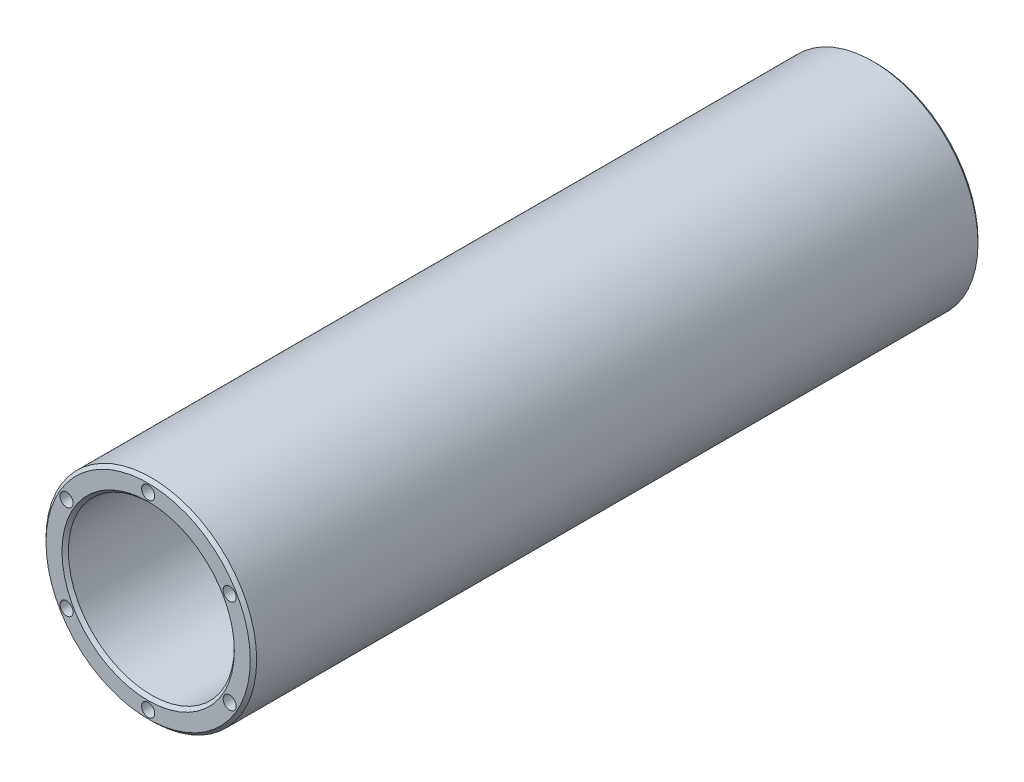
from build123d import *

# Parameters (mm, degrees)
SKETCH_1_R               = 16.5
SKETCH_1_R_2             = 13
EXTRUDE_1_DEPTH          = 57
PATTERN_CIRCULAR_1_COUNT = 6
CHAMFER_1_SIZE           = 0.5


with BuildPart() as part:
    # Sketch 1 → Extrude 1 (new, symmetric)
    with BuildSketch(Plane.XY):
        with Locations(Location((0, 0, 0), (0, 0, 180))):
            Circle(SKETCH_1_R)
        with Locations(Location((0, 0, 0), (0, 0, 180))):
            Circle(SKETCH_1_R_2, mode=Mode.SUBTRACT)
    extrude(amount=EXTRUDE_1_DEPTH, both=True)

    # Sketch 3 → Hole Wizard M2.5 _1 (revolve, cut)
    with BuildSketch(Plane(origin=(0, 14.75, -57), x_dir=(0, 1, 0), z_dir=(1, 0, 0))):
        Polygon((0, 0), (0, 12.615882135), (1.025, 12), (1.025, 0), align=None)
    hole_wizard_m2_5_1 = revolve(axis=Axis((0, 14.75, -63.35), (0, 0, 1)), mode=Mode.SUBTRACT)

    # Pattern Circular 1: Hole Wizard M2.5 _1 ×6 about axis
    pattern_circular_1_axis = Axis((0, 0, 0), (0, 0, 1))
    for i in range(1, PATTERN_CIRCULAR_1_COUNT):
        add(hole_wizard_m2_5_1.rotate(pattern_circular_1_axis, i * 360 / PATTERN_CIRCULAR_1_COUNT), mode=Mode.SUBTRACT)

    # Mirror 1: Hole Wizard M2.5 _1 across plane
    add(hole_wizard_m2_5_1.mirror(Plane.XY), mode=Mode.SUBTRACT)

    # Mirror 1 copy 1 sketch → Mirror 1 copy 1 (revolve, cut)
    with BuildSketch(Plane(origin=(-12.773874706, 7.375, 57), x_dir=(-0.8660254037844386, 0.5000000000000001, 0), z_dir=(0.5000000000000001, 0.8660254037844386, 0))):
        Polygon((0, 0), (0, -12.615882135), (1.025, -12), (1.025, 0), align=None)
    revolve(axis=Axis((-12.773874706, 7.375, 63.35), (0, 0, 1)), mode=Mode.SUBTRACT)

    # Mirror 1 copy 2 sketch → Mirror 1 copy 2 (revolve, cut)
    with BuildSketch(Plane(origin=(-12.773874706, -7.375, 57), x_dir=(-0.8660254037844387, -0.4999999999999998, 0), z_dir=(-0.4999999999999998, 0.8660254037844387, 0))):
        Polygon((0, 0), (0, -12.615882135), (1.025, -12), (1.025, 0), align=None)
    revolve(axis=Axis((-12.773874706, -7.375, 63.35), (0, 0, 1)), mode=Mode.SUBTRACT)

    # Mirror 1 copy 3 sketch → Mirror 1 copy 3 (revolve, cut)
    with BuildSketch(Plane(origin=(0, -14.75, 57), x_dir=(0, -1, 0), z_dir=(-1, 0, 0))):
        Polygon((0, 0), (0, -12.615882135), (1.025, -12), (1.025, 0), align=None)
    revolve(axis=Axis((0, -14.75, 63.35), (0, 0, 1)), mode=Mode.SUBTRACT)

    # Mirror 1 copy 4 sketch → Mirror 1 copy 4 (revolve, cut)
    with BuildSketch(Plane(origin=(12.773874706, -7.375, 57), x_dir=(0.8660254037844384, -0.5000000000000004, 0), z_dir=(-0.5000000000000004, -0.8660254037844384, 0))):
        Polygon((0, 0), (0, -12.615882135), (1.025, -12), (1.025, 0), align=None)
    revolve(axis=Axis((12.773874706, -7.375, 63.35), (0, 0, 1)), mode=Mode.SUBTRACT)

    # Mirror 1 copy 5 sketch → Mirror 1 copy 5 (revolve, cut)
    with BuildSketch(Plane(origin=(12.773874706, 7.375, 57), x_dir=(0.8660254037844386, 0.5000000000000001, 0), z_dir=(0.5000000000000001, -0.8660254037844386, 0))):
        Polygon((0, 0), (0, -12.615882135), (1.025, -12), (1.025, 0), align=None)
    revolve(axis=Axis((12.773874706, 7.375, 63.35), (0, 0, 1)), mode=Mode.SUBTRACT)

    # Chamfer 1
    chamfer_1_edges = [part.edges().sort_by_distance(p)[0] for p in [
        (16.5, 0, -57),
        (16.5, 0, 57),
        (13, 0, -57),
        (13, 0, 57),
    ]]
    chamfer(chamfer_1_edges, length=CHAMFER_1_SIZE)


solid = part.part
